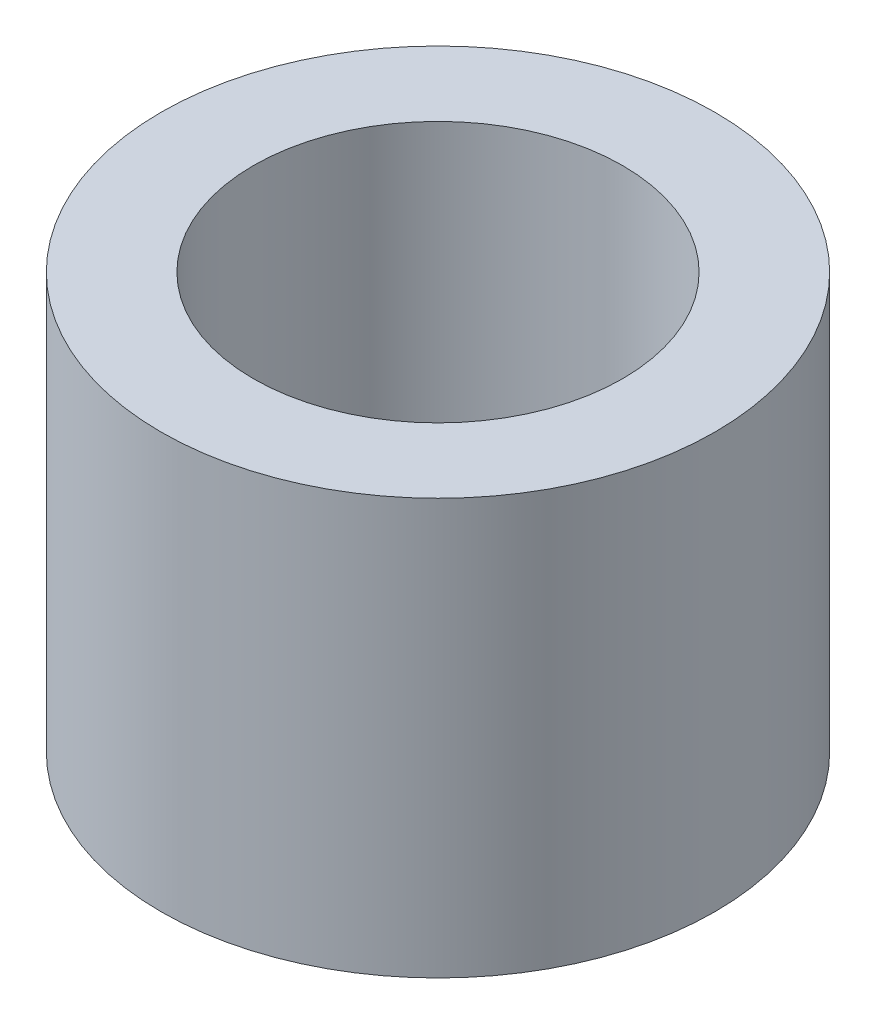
from build123d import *

# Parameters (mm, degrees)
SKETCH1_R      = 3
SKETCH1_R_2    = 2
EXTRUDE1_DEPTH = 4.5


with BuildPart() as part:
    # Sketch1 → Extrude1 (new body)
    with BuildSketch(Plane(origin=(0, 0, 0), x_dir=(1, 0, 0), z_dir=(0, 1, 0))):
        with Locations(Location((0, 0, 0), (0, 0, 270))):
            Circle(SKETCH1_R)
        with Locations(Location((0, 0, 0), (0, 0, 270))):
            Circle(SKETCH1_R_2, mode=Mode.SUBTRACT)
    extrude(amount=EXTRUDE1_DEPTH)


solid = part.part
